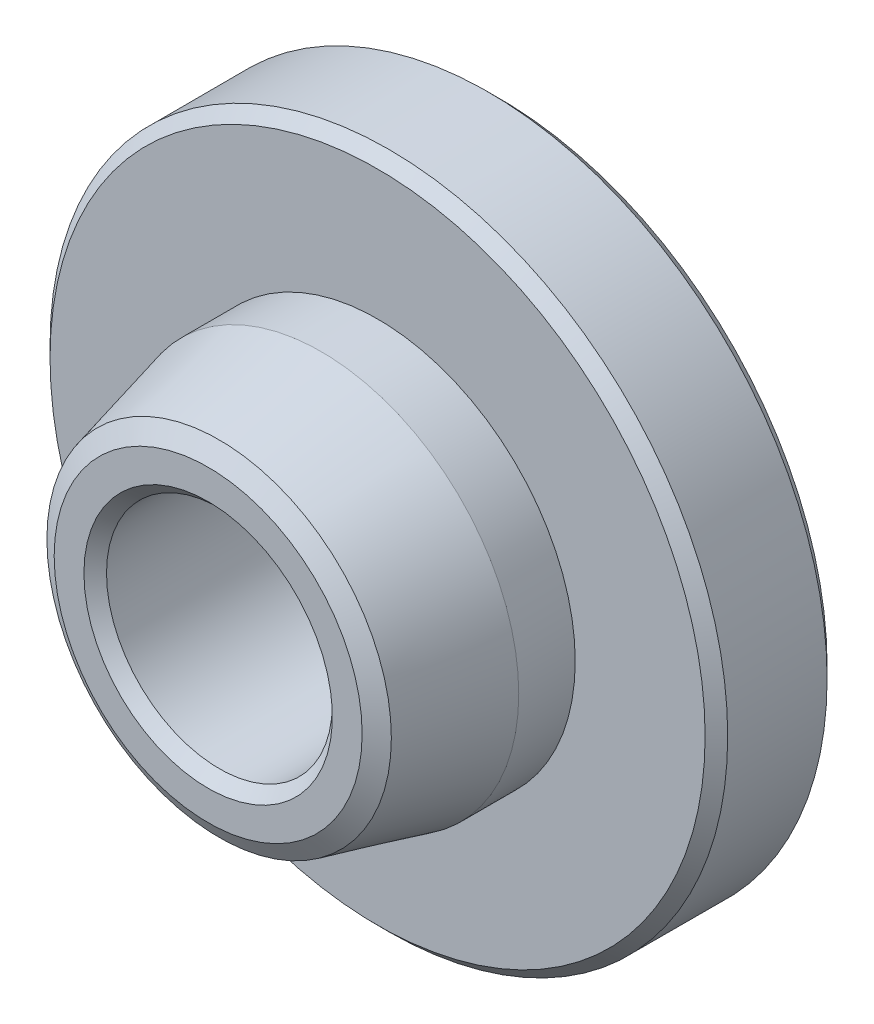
from build123d import *
from OCP.BRepFilletAPI import BRepFilletAPI_MakeChamfer

# Parameters (mm, degrees)
AUFSATZ_LINEAR_AUSTRAGEN1_DEPTH = 1.3
VERRUNDUNG1_R                   = 0.5
KREISMUSTER1_COUNT              = 10
VERRUNDUNG1_OF_KREISMUSTER1_R   = 0.5
FASE1_SIZE                      = 0.2
FASE1_SIZE2                     = 0.274584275


with BuildPart() as part:
    # Skizze1 → Rotation1 (revolve)
    with BuildSketch(Plane(origin=(0, 0, 0), x_dir=(0, 0, -1), z_dir=(1, 0, 0)), mode=Mode.PRIVATE) as rotation1_sk:
        Polygon((0, 2), (-4.66, 2), (-4.66, 3.001343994), (-2.66, 3.5), (-1.66, 3.5), (-1.66, 6), (0, 6), (1.3, 6), (1.3, 4.57), (0, 4.57), align=None)
    revolve(rotation1_sk.sketch.rotate(Axis((0, 0, 23.408695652), (0, 0, -1)), 90), axis=Axis((0, 0, 23.408695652), (0, 0, -1)))

    # Skizze4 → Aufsatz-Linear austragen1 (add)
    with BuildSketch(Plane(origin=(0, 0, 0), x_dir=(-1, 0, 0), z_dir=(0, 0, -1))):
        with BuildLine():
            Line((-0.808470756, 3.57), (-1.2, 4.409637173))
            ThreePointArc((-1.2, 4.409637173), (0, 4.57), (1.2, 4.409637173))
            Line((1.2, 4.409637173), (0.808470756, 3.57))
            Line((0.808470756, 3.57), (-0.808470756, 3.57))
        make_face()
    aufsatz_linear_austragen1 = extrude(amount=AUFSATZ_LINEAR_AUSTRAGEN1_DEPTH)

    # Verrundung1
    verrundung1_edges = [part.edges().sort_by_distance(p)[0] for p in [
        (-0.808470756, 3.57, -0.65),
        (0.808470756, 3.57, -0.65),
    ]]
    fillet(verrundung1_edges, radius=VERRUNDUNG1_R)

    # Kreismuster1: Aufsatz-Linear austragen1 ×10 about axis
    kreismuster1_axis = Axis((0, 0, 0), (0, 0, 1))
    for i in range(1, KREISMUSTER1_COUNT):
        add(aufsatz_linear_austragen1.rotate(kreismuster1_axis, i * 360 / KREISMUSTER1_COUNT))

    # Verrundung1 of Kreismuster1
    verrundung1_of_kreismuster1_edges = [part.edges().sort_by_distance(p)[0] for p in [
        (-2.752459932, 2.412983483, -0.65),
        (-1.44432677, 3.363397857, -0.65),
        (-3.645102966, 0.334289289, -0.65),
        (-3.14544056, 1.872092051, -0.65),
        (-3.14544056, -1.872092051, -0.65),
        (-3.645102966, -0.334289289, -0.65),
        (-1.44432677, -3.363397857, -0.65),
        (-2.752459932, -2.412983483, -0.65),
        (0.808470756, -3.57, -0.65),
        (-0.808470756, -3.57, -0.65),
        (2.752459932, -2.412983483, -0.65),
        (1.44432677, -3.363397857, -0.65),
        (3.645102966, -0.334289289, -0.65),
        (3.14544056, -1.872092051, -0.65),
        (3.14544056, 1.872092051, -0.65),
        (3.645102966, 0.334289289, -0.65),
        (1.44432677, 3.363397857, -0.65),
        (2.752459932, 2.412983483, -0.65),
    ]]
    fillet(verrundung1_of_kreismuster1_edges, radius=VERRUNDUNG1_OF_KREISMUSTER1_R)

    # Skizze5 → Schnitt-Rotation1 (revolve, cut)
    with BuildSketch(Plane(origin=(0, 0, 0), x_dir=(0, 0, -1), z_dir=(1, 0, 0)), mode=Mode.PRIVATE) as schnitt_rotation1_sk:
        with BuildLine():
            Line((0.5, 6), (0.5, 5))
            Line((0.5, 5), (1.153553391, 4.346446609))
            ThreePointArc((1.153553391, 4.346446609), (1.261939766, 4.184234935), (1.3, 3.992893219))
            Line((1.3, 3.992893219), (1.3, 2.59724793))
            Line((1.3, 2.59724793), (2.535311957, 2.59724793))
            Line((2.535311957, 2.59724793), (2.535311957, 6))
            Line((2.535311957, 6), (0.5, 6))
        make_face()
    revolve(schnitt_rotation1_sk.sketch.rotate(Axis((0, 0, -4.981936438), (0, 0, 1)), 270), axis=Axis((0, 0, -4.981936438), (0, 0, 1)), mode=Mode.SUBTRACT)

    # Fase1: one chamfer whose edges measure the first distance from different faces: ONE call of the kernel's chamfer builder (chamfer() names one face for all edges)
    fase1_edges_1 = [part.edges().sort_by_distance(p)[0] for p in [
        (-3.001343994, 0, 4.66),
    ]]
    fase1_side_1 = [part.faces().sort_by_distance(p)[0] for p in [
        (-3.250671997, 0, 3.66),
    ]]
    fase1_edges_2 = [part.edges().sort_by_distance(p)[0] for p in [
        (-2, 0, 4.66),
        (-2, 0, 0),
        (-6, 0, -0.5),
        (-6, 0, 1.66),
    ]]
    fase1 = BRepFilletAPI_MakeChamfer(part.part.solid().wrapped)
    for e in fase1_edges_1:
        fase1.Add(FASE1_SIZE, FASE1_SIZE2, e.wrapped, fase1_side_1[0].wrapped)  # the first distance lies on this face
    for e in fase1_edges_2:
        fase1.Add(FASE1_SIZE, e.wrapped)
    add(Compound.cast(fase1.Shape()), mode=Mode.REPLACE)


solid = part.part
